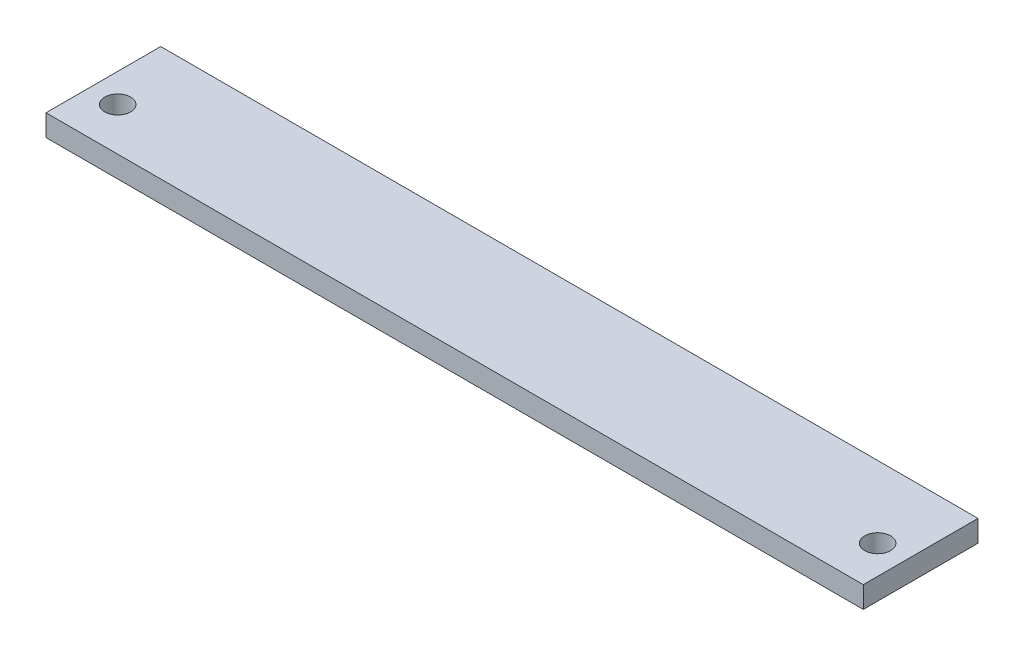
from build123d import *

# Parameters (mm, degrees)
SKETCH1_W           = 570
SKETCH1_H           = 80
BOSS_EXTRUDE1_DEPTH = 15
SKETCH2_R           = 9
CUT_EXTRUDE1_DEPTH  = 289.18396902


with BuildPart() as part:
    # Sketch1 → Boss-Extrude1 (new body)
    with BuildSketch(Plane(origin=(0, 0, 0), x_dir=(1, 0, 0), z_dir=(0, 1, 0))):
        Rectangle(SKETCH1_W, SKETCH1_H)
    extrude(amount=BOSS_EXTRUDE1_DEPTH)

    # Sketch2 → Cut-Extrude1 (cut, through all)
    with BuildSketch(Plane(origin=(0, 15, 0), x_dir=(1, 0, 0), z_dir=(0, 1, 0))):
        with Locations(Location((-265, -10, 0), (0, 0, 270))):
            Circle(SKETCH2_R)
    cut_extrude1 = extrude(amount=-CUT_EXTRUDE1_DEPTH, mode=Mode.SUBTRACT)

    # Mirror1: Cut-Extrude1 across plane
    add(cut_extrude1.mirror(Plane(origin=(0, 0, 0), x_dir=(0, 0, 1), z_dir=(1, 0, 0))), mode=Mode.SUBTRACT)


solid = part.part
